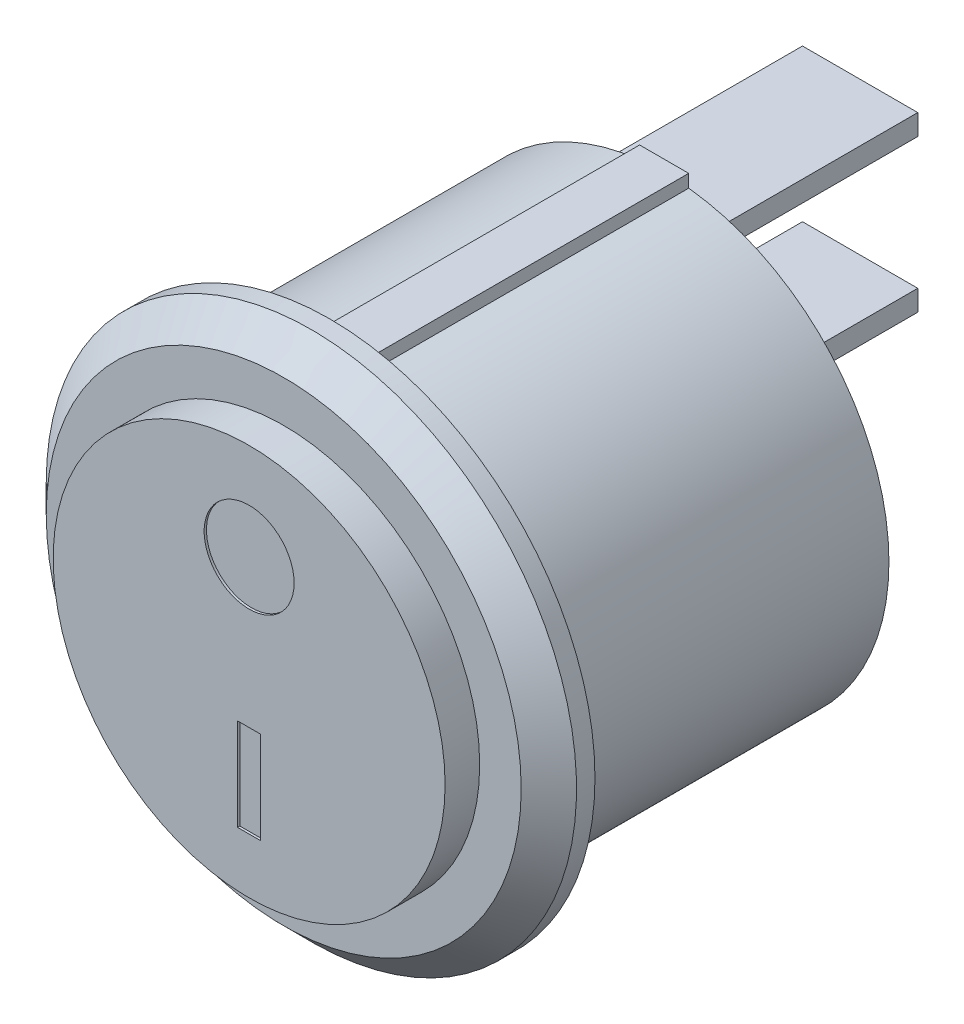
from build123d import *

# Parameters (mm, degrees)
SKIZZE1_R                       = 9.75
AUFSATZ_LINEAR_AUSTRAGEN1_DEPTH = 14.5
SKIZZE2_R                       = 11.5
AUFSATZ_LINEAR_AUSTRAGEN2_DEPTH = 2
FASE1_SIZE                      = 1.2
SKIZZE3_R                       = 8.5
AUFSATZ_LINEAR_AUSTRAGEN3_DEPTH = 1.5
SKIZZE4_R                       = 1.950478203
SKIZZE4_W                       = 1
SKIZZE4_H                       = 4
SCHNITT_LINEAR_AUSTRAGEN1_DEPTH = 0.1
SKIZZE5_W                       = 5
SKIZZE5_H                       = 0.9
AUFSATZ_LINEAR_AUSTRAGEN4_DEPTH = 8.5
SKIZZE6_W                       = 2.130311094
SKIZZE6_H                       = 20.5
AUFSATZ_LINEAR_AUSTRAGEN5_DEPTH = 14.5


with BuildPart() as part:
    # Skizze1 → Aufsatz-Linear austragen1 (new body)
    with BuildSketch(Plane.XY):
        with Locations(Location((0, 0, 0), (0, 0, 180))):
            Circle(SKIZZE1_R)
    extrude(amount=AUFSATZ_LINEAR_AUSTRAGEN1_DEPTH)

    # Skizze2 → Aufsatz-Linear austragen2 (add)
    with BuildSketch(Plane.XY.offset(14.5)):
        Circle(SKIZZE2_R)
    extrude(amount=AUFSATZ_LINEAR_AUSTRAGEN2_DEPTH)

    # Fase1
    fase1_edges = [part.edges().sort_by_distance(p)[0] for p in [
        (-11.5, 0, 16.5),
    ]]
    chamfer(fase1_edges, length=FASE1_SIZE)

    # Skizze3 → Aufsatz-Linear austragen3 (add)
    with BuildSketch(Plane.XY.offset(16.5)):
        Circle(SKIZZE3_R)
    extrude(amount=AUFSATZ_LINEAR_AUSTRAGEN3_DEPTH)

    # Skizze4 → Schnitt-Linear austragen1 (cut)
    with BuildSketch(Plane.XY.offset(18)):
        with Locations((0, 4.3)):
            Circle(SKIZZE4_R)
        with Locations((0, -4.1)):
            Rectangle(SKIZZE4_W, SKIZZE4_H)
    extrude(amount=-SCHNITT_LINEAR_AUSTRAGEN1_DEPTH, mode=Mode.SUBTRACT)

    # Skizze5 → Aufsatz-Linear austragen4 (add)
    with BuildSketch(Plane(origin=(0, 0, 0), x_dir=(-1, 0, 0), z_dir=(0, 0, -1))):
        with Locations((0, 8.55)):
            Rectangle(SKIZZE5_W, SKIZZE5_H)
        with Locations((0, 1.95)):
            Rectangle(SKIZZE5_W, SKIZZE5_H)
    extrude(amount=AUFSATZ_LINEAR_AUSTRAGEN4_DEPTH)

    # Skizze6 → Aufsatz-Linear austragen5 (add)
    with BuildSketch(Plane(origin=(0, 0, 0), x_dir=(-1, 0, 0), z_dir=(0, 0, -1))):
        Rectangle(SKIZZE6_W, SKIZZE6_H)
    extrude(amount=-AUFSATZ_LINEAR_AUSTRAGEN5_DEPTH)


solid = part.part
